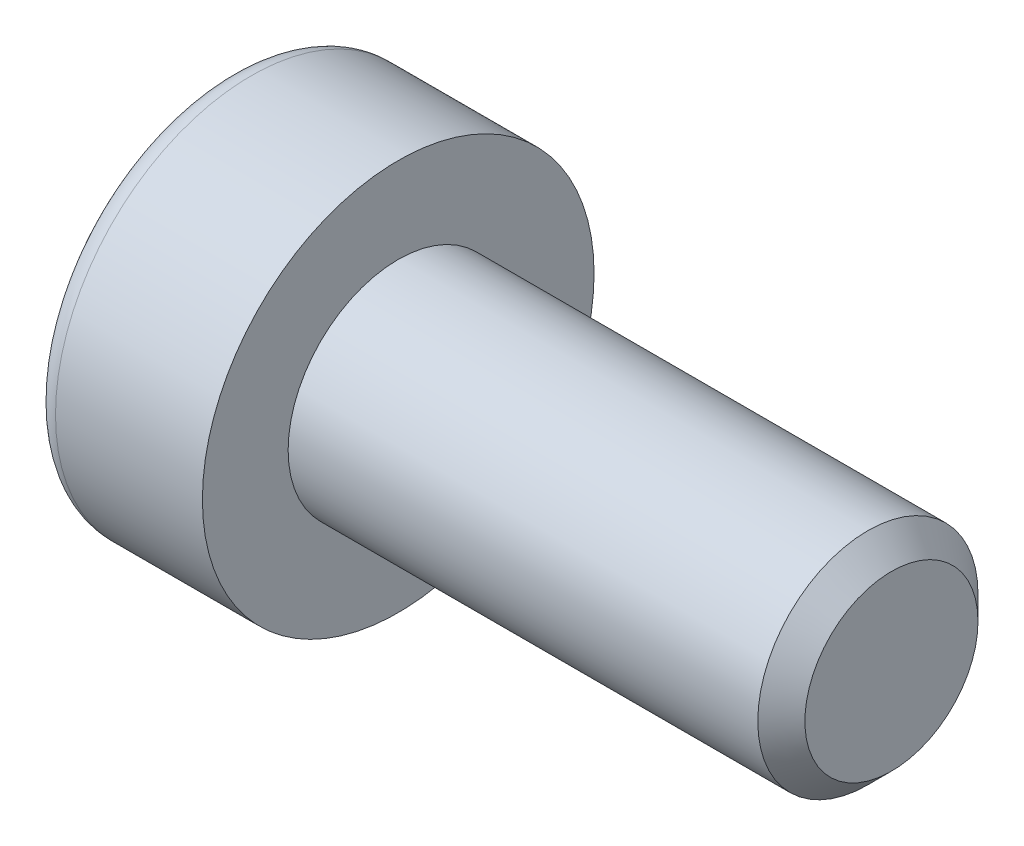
ISO-10303-21;
HEADER;
FILE_DESCRIPTION(('STEP AP214'),'2;1');
FILE_NAME('part.step','',(''),(''),'','','');
FILE_SCHEMA(('AUTOMOTIVE_DESIGN { 1 0 10303 214 1 1 1 1 }'));
ENDSEC;
DATA;
#1=APPLICATION_CONTEXT('core data for automotive mechanical design processes');
#2=APPLICATION_PROTOCOL_DEFINITION('international standard','automotive_design',2000,#1);
#3=PRODUCT_CONTEXT('',#1,'mechanical');
#4=PRODUCT('Part','Part','',(#3));
#5=PRODUCT_RELATED_PRODUCT_CATEGORY('part','',(#4));
#6=PRODUCT_DEFINITION_FORMATION('','',#4);
#7=PRODUCT_DEFINITION_CONTEXT('part definition',#1,'design');
#8=PRODUCT_DEFINITION('design','',#6,#7);
#9=PRODUCT_DEFINITION_SHAPE('','',#8);
#10=(LENGTH_UNIT() NAMED_UNIT(*) SI_UNIT(.MILLI.,.METRE.));
#11=(NAMED_UNIT(*) PLANE_ANGLE_UNIT() SI_UNIT($,.RADIAN.));
#12=(NAMED_UNIT(*) SI_UNIT($,.STERADIAN.) SOLID_ANGLE_UNIT());
#13=UNCERTAINTY_MEASURE_WITH_UNIT(LENGTH_MEASURE(1.E-05),#10,'distance_accuracy_value','');
#14=(GEOMETRIC_REPRESENTATION_CONTEXT(3) GLOBAL_UNCERTAINTY_ASSIGNED_CONTEXT((#13)) GLOBAL_UNIT_ASSIGNED_CONTEXT((#10,
#11,#12)) REPRESENTATION_CONTEXT('',''));
#15=CARTESIAN_POINT('',(0.,0.,0.));
#16=DIRECTION('',(0.,0.,1.));
#17=DIRECTION('',(1.,0.,0.));
#18=AXIS2_PLACEMENT_3D('',#15,#16,#17);
#19=CARTESIAN_POINT('',(-324.272441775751,-82.2332612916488,0.));
#20=DIRECTION('',(1.,0.,0.));
#21=DIRECTION('',(0.,0.,-1.));
#22=AXIS2_PLACEMENT_3D('',#19,#20,#21);
#23=PLANE('',#22);
#24=CARTESIAN_POINT('',(-324.272441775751,-82.2332612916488,0.));
#25=DIRECTION('',(1.,0.,0.));
#26=DIRECTION('',(0.,0.,-1.));
#27=AXIS2_PLACEMENT_3D('',#24,#25,#26);
#28=CIRCLE('',#27,1.88254870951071);
#29=CARTESIAN_POINT('',(-324.272441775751,-82.2332612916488,-1.88254870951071));
#30=VERTEX_POINT('',#29);
#31=EDGE_CURVE('E149',#30,#30,#28,.T.);
#32=ORIENTED_EDGE('',*,*,#31,.T.);
#33=EDGE_LOOP('',(#32));
#34=FACE_BOUND('',#33,.T.);
#35=ADVANCED_FACE('F33',(#34),#23,.T.);
#36=CARTESIAN_POINT('',(-324.272441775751,-82.2332612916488,0.));
#37=DIRECTION('',(-1.,0.,0.));
#38=DIRECTION('',(0.,0.,1.));
#39=AXIS2_PLACEMENT_3D('',#36,#37,#38);
#40=CONICAL_SURFACE('',#39,1.88254870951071,0.785398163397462);
#41=CARTESIAN_POINT('',(-324.784792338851,-82.2332612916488,0.));
#42=DIRECTION('',(1.,0.,0.));
#43=DIRECTION('',(0.,0.,-1.));
#44=AXIS2_PLACEMENT_3D('',#41,#42,#43);
#45=CIRCLE('',#44,2.39489927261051);
#46=CARTESIAN_POINT('',(-324.784792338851,-82.2332612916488,-2.39489927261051));
#47=VERTEX_POINT('',#46);
#48=EDGE_CURVE('E146',#47,#47,#45,.T.);
#49=ORIENTED_EDGE('',*,*,#48,.T.);
#50=EDGE_LOOP('',(#49));
#51=FACE_BOUND('',#50,.T.);
#52=ORIENTED_EDGE('',*,*,#31,.F.);
#53=EDGE_LOOP('',(#52));
#54=FACE_BOUND('',#53,.T.);
#55=ADVANCED_FACE('F166',(#51,#54),#40,.T.);
#56=CARTESIAN_POINT('',(-324.272441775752,-82.2332612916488,0.));
#57=DIRECTION('',(1.,0.,0.));
#58=DIRECTION('',(0.,0.,-1.));
#59=AXIS2_PLACEMENT_3D('',#56,#57,#58);
#60=CYLINDRICAL_SURFACE('',#59,2.39489927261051);
#61=CARTESIAN_POINT('',(-335.,-82.2332612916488,0.));
#62=DIRECTION('',(1.,0.,0.));
#63=DIRECTION('',(0.,0.,-1.));
#64=AXIS2_PLACEMENT_3D('',#61,#62,#63);
#65=CIRCLE('',#64,2.39489927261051);
#66=CARTESIAN_POINT('',(-335.,-82.2332612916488,-2.39489927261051));
#67=VERTEX_POINT('',#66);
#68=EDGE_CURVE('E143',#67,#67,#65,.T.);
#69=ORIENTED_EDGE('',*,*,#68,.T.);
#70=EDGE_LOOP('',(#69));
#71=FACE_BOUND('',#70,.T.);
#72=ORIENTED_EDGE('',*,*,#48,.F.);
#73=EDGE_LOOP('',(#72));
#74=FACE_BOUND('',#73,.T.);
#75=ADVANCED_FACE('F171',(#71,#74),#60,.T.);
#76=CARTESIAN_POINT('',(-335.,-79.8383620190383,0.));
#77=DIRECTION('',(1.,0.,0.));
#78=DIRECTION('',(0.,0.,-1.));
#79=AXIS2_PLACEMENT_3D('',#76,#77,#78);
#80=PLANE('',#79);
#81=CARTESIAN_POINT('',(-335.,-82.2332612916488,0.));
#82=DIRECTION('',(1.,0.,0.));
#83=DIRECTION('',(0.,0.,-1.));
#84=AXIS2_PLACEMENT_3D('',#81,#82,#83);
#85=CIRCLE('',#84,4.25951204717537);
#86=CARTESIAN_POINT('',(-335.,-82.2332612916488,-4.25951204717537));
#87=VERTEX_POINT('',#86);
#88=EDGE_CURVE('E135',#87,#87,#85,.T.);
#89=ORIENTED_EDGE('',*,*,#88,.T.);
#90=EDGE_LOOP('',(#89));
#91=FACE_BOUND('',#90,.T.);
#92=ORIENTED_EDGE('',*,*,#68,.F.);
#93=EDGE_LOOP('',(#92));
#94=FACE_BOUND('',#93,.T.);
#95=ADVANCED_FACE('F177',(#91,#94),#80,.T.);
#96=CARTESIAN_POINT('',(-324.272441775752,-82.2332612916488,0.));
#97=DIRECTION('',(1.,0.,0.));
#98=DIRECTION('',(0.,0.,-1.));
#99=AXIS2_PLACEMENT_3D('',#96,#97,#98);
#100=CYLINDRICAL_SURFACE('',#99,4.25951204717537);
#101=CARTESIAN_POINT('',(-338.195213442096,-82.2332612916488,0.));
#102=DIRECTION('',(-1.,0.,0.));
#103=DIRECTION('',(0.,0.,1.));
#104=AXIS2_PLACEMENT_3D('',#101,#102,#103);
#105=CIRCLE('',#104,4.25951204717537);
#106=CARTESIAN_POINT('',(-338.195213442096,-82.2332612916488,4.25951204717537));
#107=VERTEX_POINT('',#106);
#108=EDGE_CURVE('E41',#107,#107,#105,.F.);
#109=ORIENTED_EDGE('',*,*,#108,.T.);
#110=EDGE_LOOP('',(#109));
#111=FACE_BOUND('',#110,.T.);
#112=ORIENTED_EDGE('',*,*,#88,.F.);
#113=EDGE_LOOP('',(#112));
#114=FACE_BOUND('',#113,.T.);
#115=ADVANCED_FACE('F154',(#111,#114),#100,.T.);
#116=CARTESIAN_POINT('',(-338.695213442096,-77.9737492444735,0.));
#117=DIRECTION('',(-1.,0.,0.));
#118=DIRECTION('',(0.,0.,1.));
#119=AXIS2_PLACEMENT_3D('',#116,#117,#118);
#120=PLANE('',#119);
#121=CARTESIAN_POINT('',(-338.695213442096,-82.2332612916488,0.));
#122=DIRECTION('',(-1.,0.,0.));
#123=DIRECTION('',(0.,0.,1.));
#124=AXIS2_PLACEMENT_3D('',#121,#122,#123);
#125=CIRCLE('',#124,3.75951204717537);
#126=CARTESIAN_POINT('',(-338.695213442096,-82.2332612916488,3.75951204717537));
#127=VERTEX_POINT('',#126);
#128=EDGE_CURVE('E11',#127,#127,#125,.T.);
#129=ORIENTED_EDGE('',*,*,#128,.T.);
#130=EDGE_LOOP('',(#129));
#131=FACE_BOUND('',#130,.T.);
#132=DIRECTION('',(0.,0.374877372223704,-0.927074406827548));
#133=VECTOR('',#132,1.);
#134=CARTESIAN_POINT('',(-338.695213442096,-80.7394153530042,1.91318709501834));
#135=LINE('',#134,#133);
#136=CARTESIAN_POINT('',(-338.695213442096,-80.7394153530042,1.91318709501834));
#137=VERTEX_POINT('',#136);
#138=CARTESIAN_POINT('',(-338.695213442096,-79.8294696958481,-0.337114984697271));
#139=VERTEX_POINT('',#138);
#140=EDGE_CURVE('E48',#137,#139,#135,.T.);
#141=ORIENTED_EDGE('',*,*,#140,.F.);
#142=DIRECTION('',(0.,0.990308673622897,-0.138883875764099));
#143=VECTOR('',#142,1.);
#144=CARTESIAN_POINT('',(-338.695213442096,-83.1432069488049,2.25030207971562));
#145=LINE('',#144,#143);
#146=CARTESIAN_POINT('',(-338.695213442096,-83.1432069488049,2.25030207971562));
#147=VERTEX_POINT('',#146);
#148=EDGE_CURVE('E131',#147,#137,#145,.T.);
#149=ORIENTED_EDGE('',*,*,#148,.F.);
#150=DIRECTION('',(0.,0.615431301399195,0.788190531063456));
#151=VECTOR('',#150,1.);
#152=CARTESIAN_POINT('',(-338.695213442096,-84.6370528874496,0.337114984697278));
#153=LINE('',#152,#151);
#154=CARTESIAN_POINT('',(-338.695213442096,-84.6370528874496,0.337114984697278));
#155=VERTEX_POINT('',#154);
#156=EDGE_CURVE('E129',#155,#147,#153,.T.);
#157=ORIENTED_EDGE('',*,*,#156,.F.);
#158=DIRECTION('',(0.,-0.374877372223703,0.927074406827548));
#159=VECTOR('',#158,1.);
#160=CARTESIAN_POINT('',(-338.695213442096,-83.7271072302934,-1.91318709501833));
#161=LINE('',#160,#159);
#162=CARTESIAN_POINT('',(-338.695213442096,-83.7271072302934,-1.91318709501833));
#163=VERTEX_POINT('',#162);
#164=EDGE_CURVE('E96',#163,#155,#161,.T.);
#165=ORIENTED_EDGE('',*,*,#164,.F.);
#166=DIRECTION('',(0.,-0.990308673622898,0.138883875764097));
#167=VECTOR('',#166,1.);
#168=CARTESIAN_POINT('',(-338.695213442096,-81.3233156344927,-2.25030207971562));
#169=LINE('',#168,#167);
#170=CARTESIAN_POINT('',(-338.695213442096,-81.3233156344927,-2.25030207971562));
#171=VERTEX_POINT('',#170);
#172=EDGE_CURVE('E125',#171,#163,#169,.T.);
#173=ORIENTED_EDGE('',*,*,#172,.F.);
#174=DIRECTION('',(0.,-0.615431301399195,-0.788190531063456));
#175=VECTOR('',#174,1.);
#176=CARTESIAN_POINT('',(-338.695213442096,-79.8294696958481,-0.337114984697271));
#177=LINE('',#176,#175);
#178=EDGE_CURVE('E122',#139,#171,#177,.T.);
#179=ORIENTED_EDGE('',*,*,#178,.F.);
#180=EDGE_LOOP('',(#141,#149,#157,#165,#173,#179));
#181=FACE_BOUND('',#180,.T.);
#182=ADVANCED_FACE('F184',(#131,#181),#120,.T.);
#183=CARTESIAN_POINT('',(-336.695213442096,-80.7394153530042,1.91318709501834));
#184=DIRECTION('',(0.,0.927074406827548,0.374877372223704));
#185=DIRECTION('',(0.,-0.374877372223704,0.927074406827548));
#186=AXIS2_PLACEMENT_3D('',#183,#184,#185);
#187=PLANE('',#186);
#188=ORIENTED_EDGE('',*,*,#140,.T.);
#189=DIRECTION('',(-1.,0.,0.));
#190=VECTOR('',#189,1.);
#191=CARTESIAN_POINT('',(-336.695213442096,-79.8294696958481,-0.337114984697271));
#192=LINE('',#191,#190);
#193=CARTESIAN_POINT('',(-336.695213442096,-79.8294696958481,-0.337114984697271));
#194=VERTEX_POINT('',#193);
#195=EDGE_CURVE('E78',#194,#139,#192,.T.);
#196=ORIENTED_EDGE('',*,*,#195,.F.);
#197=DIRECTION('',(0.,0.374877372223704,-0.927074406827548));
#198=VECTOR('',#197,1.);
#199=CARTESIAN_POINT('',(-336.695213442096,-80.7394153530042,1.91318709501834));
#200=LINE('',#199,#198);
#201=CARTESIAN_POINT('',(-336.695213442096,-80.7394153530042,1.91318709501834));
#202=VERTEX_POINT('',#201);
#203=EDGE_CURVE('E133',#202,#194,#200,.T.);
#204=ORIENTED_EDGE('',*,*,#203,.F.);
#205=DIRECTION('',(-1.,0.,0.));
#206=VECTOR('',#205,1.);
#207=CARTESIAN_POINT('',(-336.695213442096,-80.7394153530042,1.91318709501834));
#208=LINE('',#207,#206);
#209=EDGE_CURVE('E56',#202,#137,#208,.T.);
#210=ORIENTED_EDGE('',*,*,#209,.T.);
#211=EDGE_LOOP('',(#188,#196,#204,#210));
#212=FACE_BOUND('',#211,.T.);
#213=ADVANCED_FACE('F187',(#212),#187,.F.);
#214=CARTESIAN_POINT('',(-336.695213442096,-83.1432069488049,2.25030207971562));
#215=DIRECTION('',(0.,0.138883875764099,0.990308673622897));
#216=DIRECTION('',(0.,-0.990308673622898,0.138883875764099));
#217=AXIS2_PLACEMENT_3D('',#214,#215,#216);
#218=PLANE('',#217);
#219=ORIENTED_EDGE('',*,*,#148,.T.);
#220=ORIENTED_EDGE('',*,*,#209,.F.);
#221=DIRECTION('',(0.,0.990308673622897,-0.138883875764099));
#222=VECTOR('',#221,1.);
#223=CARTESIAN_POINT('',(-336.695213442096,-83.1432069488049,2.25030207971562));
#224=LINE('',#223,#222);
#225=CARTESIAN_POINT('',(-336.695213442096,-83.1432069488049,2.25030207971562));
#226=VERTEX_POINT('',#225);
#227=EDGE_CURVE('E108',#226,#202,#224,.T.);
#228=ORIENTED_EDGE('',*,*,#227,.F.);
#229=DIRECTION('',(-1.,0.,0.));
#230=VECTOR('',#229,1.);
#231=CARTESIAN_POINT('',(-336.695213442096,-83.1432069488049,2.25030207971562));
#232=LINE('',#231,#230);
#233=EDGE_CURVE('E100',#226,#147,#232,.T.);
#234=ORIENTED_EDGE('',*,*,#233,.T.);
#235=EDGE_LOOP('',(#219,#220,#228,#234));
#236=FACE_BOUND('',#235,.T.);
#237=ADVANCED_FACE('F191',(#236),#218,.F.);
#238=CARTESIAN_POINT('',(-336.695213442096,-84.6370528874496,0.337114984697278));
#239=DIRECTION('',(0.,-0.788190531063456,0.615431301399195));
#240=DIRECTION('',(0.,-0.615431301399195,-0.788190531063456));
#241=AXIS2_PLACEMENT_3D('',#238,#239,#240);
#242=PLANE('',#241);
#243=ORIENTED_EDGE('',*,*,#156,.T.);
#244=ORIENTED_EDGE('',*,*,#233,.F.);
#245=DIRECTION('',(0.,0.615431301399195,0.788190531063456));
#246=VECTOR('',#245,1.);
#247=CARTESIAN_POINT('',(-336.695213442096,-84.6370528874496,0.337114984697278));
#248=LINE('',#247,#246);
#249=CARTESIAN_POINT('',(-336.695213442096,-84.6370528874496,0.337114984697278));
#250=VERTEX_POINT('',#249);
#251=EDGE_CURVE('E104',#250,#226,#248,.T.);
#252=ORIENTED_EDGE('',*,*,#251,.F.);
#253=DIRECTION('',(-1.,0.,0.));
#254=VECTOR('',#253,1.);
#255=CARTESIAN_POINT('',(-336.695213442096,-84.6370528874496,0.337114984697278));
#256=LINE('',#255,#254);
#257=EDGE_CURVE('E89',#250,#155,#256,.T.);
#258=ORIENTED_EDGE('',*,*,#257,.T.);
#259=EDGE_LOOP('',(#243,#244,#252,#258));
#260=FACE_BOUND('',#259,.T.);
#261=ADVANCED_FACE('F105',(#260),#242,.F.);
#262=CARTESIAN_POINT('',(-336.695213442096,-83.7271072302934,-1.91318709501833));
#263=DIRECTION('',(0.,-0.927074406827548,-0.374877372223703));
#264=DIRECTION('',(0.,0.374877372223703,-0.927074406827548));
#265=AXIS2_PLACEMENT_3D('',#262,#263,#264);
#266=PLANE('',#265);
#267=ORIENTED_EDGE('',*,*,#164,.T.);
#268=ORIENTED_EDGE('',*,*,#257,.F.);
#269=DIRECTION('',(0.,-0.374877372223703,0.927074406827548));
#270=VECTOR('',#269,1.);
#271=CARTESIAN_POINT('',(-336.695213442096,-83.7271072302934,-1.91318709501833));
#272=LINE('',#271,#270);
#273=CARTESIAN_POINT('',(-336.695213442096,-83.7271072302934,-1.91318709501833));
#274=VERTEX_POINT('',#273);
#275=EDGE_CURVE('E93',#274,#250,#272,.T.);
#276=ORIENTED_EDGE('',*,*,#275,.F.);
#277=DIRECTION('',(-1.,0.,0.));
#278=VECTOR('',#277,1.);
#279=CARTESIAN_POINT('',(-336.695213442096,-83.7271072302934,-1.91318709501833));
#280=LINE('',#279,#278);
#281=EDGE_CURVE('E101',#274,#163,#280,.T.);
#282=ORIENTED_EDGE('',*,*,#281,.T.);
#283=EDGE_LOOP('',(#267,#268,#276,#282));
#284=FACE_BOUND('',#283,.T.);
#285=ADVANCED_FACE('F91',(#284),#266,.F.);
#286=CARTESIAN_POINT('',(-336.695213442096,-81.3233156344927,-2.25030207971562));
#287=DIRECTION('',(0.,-0.138883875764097,-0.990308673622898));
#288=DIRECTION('',(0.,0.990308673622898,-0.138883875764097));
#289=AXIS2_PLACEMENT_3D('',#286,#287,#288);
#290=PLANE('',#289);
#291=ORIENTED_EDGE('',*,*,#172,.T.);
#292=ORIENTED_EDGE('',*,*,#281,.F.);
#293=DIRECTION('',(0.,-0.990308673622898,0.138883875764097));
#294=VECTOR('',#293,1.);
#295=CARTESIAN_POINT('',(-336.695213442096,-81.3233156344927,-2.25030207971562));
#296=LINE('',#295,#294);
#297=CARTESIAN_POINT('',(-336.695213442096,-81.3233156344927,-2.25030207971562));
#298=VERTEX_POINT('',#297);
#299=EDGE_CURVE('E114',#298,#274,#296,.T.);
#300=ORIENTED_EDGE('',*,*,#299,.F.);
#301=DIRECTION('',(-1.,0.,0.));
#302=VECTOR('',#301,1.);
#303=CARTESIAN_POINT('',(-336.695213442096,-81.3233156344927,-2.25030207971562));
#304=LINE('',#303,#302);
#305=EDGE_CURVE('E138',#298,#171,#304,.T.);
#306=ORIENTED_EDGE('',*,*,#305,.T.);
#307=EDGE_LOOP('',(#291,#292,#300,#306));
#308=FACE_BOUND('',#307,.T.);
#309=ADVANCED_FACE('F194',(#308),#290,.F.);
#310=CARTESIAN_POINT('',(-336.695213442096,-79.8294696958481,-0.337114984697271));
#311=DIRECTION('',(0.,0.788190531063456,-0.615431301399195));
#312=DIRECTION('',(0.,0.615431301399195,0.788190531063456));
#313=AXIS2_PLACEMENT_3D('',#310,#311,#312);
#314=PLANE('',#313);
#315=ORIENTED_EDGE('',*,*,#178,.T.);
#316=ORIENTED_EDGE('',*,*,#305,.F.);
#317=DIRECTION('',(0.,-0.615431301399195,-0.788190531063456));
#318=VECTOR('',#317,1.);
#319=CARTESIAN_POINT('',(-336.695213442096,-79.8294696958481,-0.337114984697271));
#320=LINE('',#319,#318);
#321=EDGE_CURVE('E116',#194,#298,#320,.T.);
#322=ORIENTED_EDGE('',*,*,#321,.F.);
#323=ORIENTED_EDGE('',*,*,#195,.T.);
#324=EDGE_LOOP('',(#315,#316,#322,#323));
#325=FACE_BOUND('',#324,.T.);
#326=ADVANCED_FACE('F162',(#325),#314,.F.);
#327=CARTESIAN_POINT('',(-336.695213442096,-79.8294696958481,-0.337114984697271));
#328=DIRECTION('',(-1.,0.,0.));
#329=DIRECTION('',(0.,0.,1.));
#330=AXIS2_PLACEMENT_3D('',#327,#328,#329);
#331=PLANE('',#330);
#332=ORIENTED_EDGE('',*,*,#203,.T.);
#333=ORIENTED_EDGE('',*,*,#321,.T.);
#334=ORIENTED_EDGE('',*,*,#299,.T.);
#335=ORIENTED_EDGE('',*,*,#275,.T.);
#336=ORIENTED_EDGE('',*,*,#251,.T.);
#337=ORIENTED_EDGE('',*,*,#227,.T.);
#338=EDGE_LOOP('',(#332,#333,#334,#335,#336,#337));
#339=FACE_BOUND('',#338,.T.);
#340=ADVANCED_FACE('F111',(#339),#331,.T.);
#341=CARTESIAN_POINT('',(-338.195213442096,-82.2332612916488,0.));
#342=DIRECTION('',(-1.,0.,0.));
#343=DIRECTION('',(0.,0.,1.));
#344=AXIS2_PLACEMENT_3D('',#341,#342,#343);
#345=TOROIDAL_SURFACE('',#344,3.75951204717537,0.5);
#346=ORIENTED_EDGE('',*,*,#128,.F.);
#347=EDGE_LOOP('',(#346));
#348=FACE_BOUND('',#347,.T.);
#349=ORIENTED_EDGE('',*,*,#108,.F.);
#350=EDGE_LOOP('',(#349));
#351=FACE_BOUND('',#350,.T.);
#352=ADVANCED_FACE('F35',(#348,#351),#345,.T.);
#353=CLOSED_SHELL('',(#35,#55,#75,#95,#115,#182,#213,#237,#261,#285,#309,#326,#340,#352));
#354=MANIFOLD_SOLID_BREP('B2',#353);
#355=ADVANCED_BREP_SHAPE_REPRESENTATION('',(#18,#354),#14);
#356=SHAPE_DEFINITION_REPRESENTATION(#9,#355);
ENDSEC;
END-ISO-10303-21;
